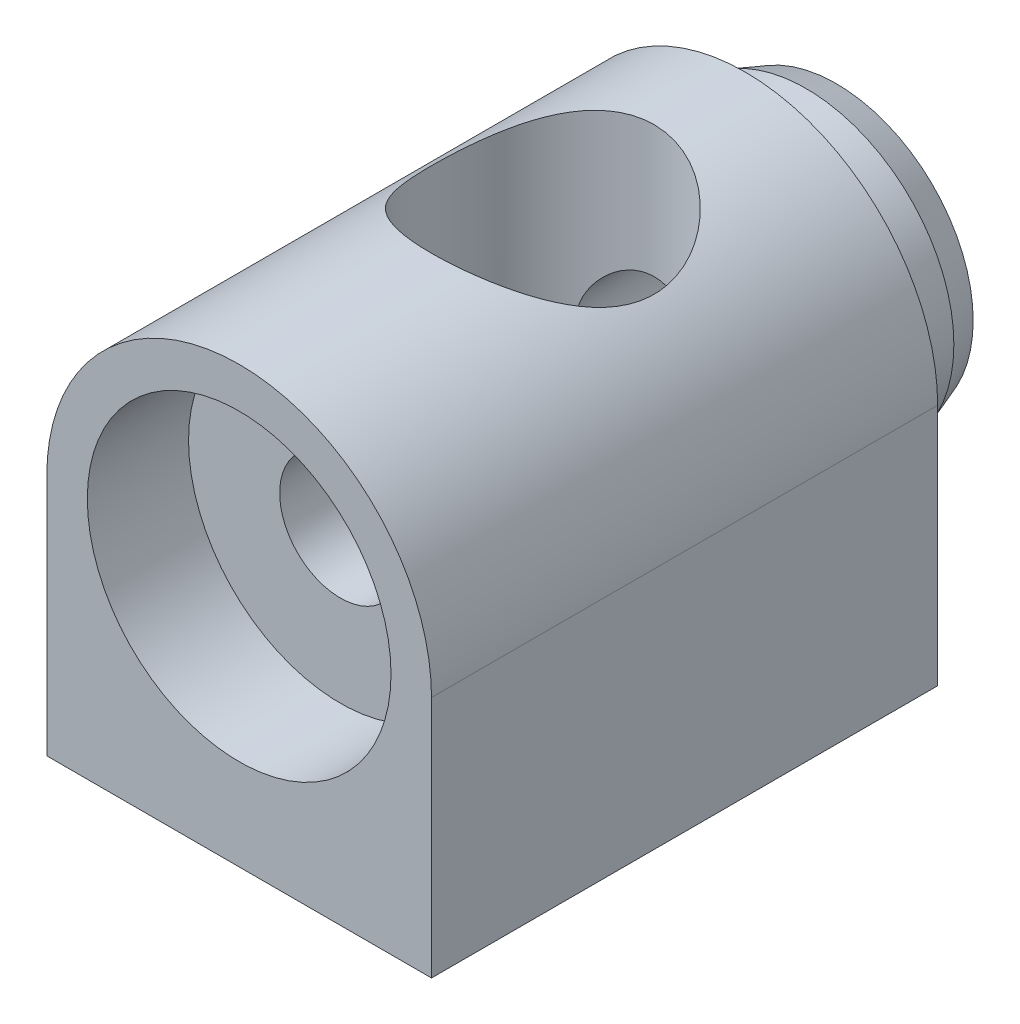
ISO-10303-21;
HEADER;
FILE_DESCRIPTION(('STEP AP214'),'2;1');
FILE_NAME('part.step','',(''),(''),'','','');
FILE_SCHEMA(('AUTOMOTIVE_DESIGN { 1 0 10303 214 1 1 1 1 }'));
ENDSEC;
DATA;
#1=APPLICATION_CONTEXT('core data for automotive mechanical design processes');
#2=APPLICATION_PROTOCOL_DEFINITION('international standard','automotive_design',2000,#1);
#3=PRODUCT_CONTEXT('',#1,'mechanical');
#4=PRODUCT('Part','Part','',(#3));
#5=PRODUCT_RELATED_PRODUCT_CATEGORY('part','',(#4));
#6=PRODUCT_DEFINITION_FORMATION('','',#4);
#7=PRODUCT_DEFINITION_CONTEXT('part definition',#1,'design');
#8=PRODUCT_DEFINITION('design','',#6,#7);
#9=PRODUCT_DEFINITION_SHAPE('','',#8);
#10=(LENGTH_UNIT() NAMED_UNIT(*) SI_UNIT(.MILLI.,.METRE.));
#11=(NAMED_UNIT(*) PLANE_ANGLE_UNIT() SI_UNIT($,.RADIAN.));
#12=(NAMED_UNIT(*) SI_UNIT($,.STERADIAN.) SOLID_ANGLE_UNIT());
#13=UNCERTAINTY_MEASURE_WITH_UNIT(LENGTH_MEASURE(1.E-05),#10,'distance_accuracy_value','');
#14=(GEOMETRIC_REPRESENTATION_CONTEXT(3) GLOBAL_UNCERTAINTY_ASSIGNED_CONTEXT((#13)) GLOBAL_UNIT_ASSIGNED_CONTEXT((#10,
#11,#12)) REPRESENTATION_CONTEXT('',''));
#15=CARTESIAN_POINT('',(0.,0.,0.));
#16=DIRECTION('',(0.,0.,1.));
#17=DIRECTION('',(1.,0.,0.));
#18=AXIS2_PLACEMENT_3D('',#15,#16,#17);
#19=CARTESIAN_POINT('',(0.,-82.3561549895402,10.5));
#20=DIRECTION('',(0.,0.,-1.));
#21=DIRECTION('',(-1.,0.,0.));
#22=AXIS2_PLACEMENT_3D('',#19,#20,#21);
#23=PLANE('',#22);
#24=DIRECTION('',(0.866025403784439,0.5,0.));
#25=VECTOR('',#24,1.);
#26=CARTESIAN_POINT('',(0.,-84.7526353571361,10.5));
#27=LINE('',#26,#25);
#28=CARTESIAN_POINT('',(0.,-84.7526353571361,10.5));
#29=VERTEX_POINT('',#28);
#30=CARTESIAN_POINT('',(5.00000000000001,-81.865884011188,10.5));
#31=VERTEX_POINT('',#30);
#32=EDGE_CURVE('E217',#29,#31,#27,.T.);
#33=ORIENTED_EDGE('',*,*,#32,.T.);
#34=DIRECTION('',(0.,1.,0.));
#35=VECTOR('',#34,1.);
#36=CARTESIAN_POINT('',(5.,-81.865884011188,10.5));
#37=LINE('',#36,#35);
#38=CARTESIAN_POINT('',(5.,-76.0923813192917,10.5));
#39=VERTEX_POINT('',#38);
#40=EDGE_CURVE('E223',#31,#39,#37,.T.);
#41=ORIENTED_EDGE('',*,*,#40,.T.);
#42=DIRECTION('',(-0.866025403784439,0.5,0.));
#43=VECTOR('',#42,1.);
#44=CARTESIAN_POINT('',(5.,-76.0923813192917,10.5));
#45=LINE('',#44,#43);
#46=CARTESIAN_POINT('',(0.,-73.2056299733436,10.5));
#47=VERTEX_POINT('',#46);
#48=EDGE_CURVE('E190',#39,#47,#45,.T.);
#49=ORIENTED_EDGE('',*,*,#48,.T.);
#50=DIRECTION('',(-0.866025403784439,-0.5,0.));
#51=VECTOR('',#50,1.);
#52=CARTESIAN_POINT('',(0.,-73.2056299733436,10.5));
#53=LINE('',#52,#51);
#54=CARTESIAN_POINT('',(-5.,-76.0923813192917,10.5));
#55=VERTEX_POINT('',#54);
#56=EDGE_CURVE('E199',#47,#55,#53,.T.);
#57=ORIENTED_EDGE('',*,*,#56,.T.);
#58=DIRECTION('',(0.,1.,0.));
#59=VECTOR('',#58,1.);
#60=CARTESIAN_POINT('',(-5.,-76.0923813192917,10.5));
#61=LINE('',#60,#59);
#62=CARTESIAN_POINT('',(-5.,-81.865884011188,10.5));
#63=VERTEX_POINT('',#62);
#64=EDGE_CURVE('E205',#55,#63,#61,.F.);
#65=ORIENTED_EDGE('',*,*,#64,.T.);
#66=DIRECTION('',(0.866025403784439,-0.5,0.));
#67=VECTOR('',#66,1.);
#68=CARTESIAN_POINT('',(-5.,-81.865884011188,10.5));
#69=LINE('',#68,#67);
#70=EDGE_CURVE('E211',#63,#29,#69,.T.);
#71=ORIENTED_EDGE('',*,*,#70,.T.);
#72=EDGE_LOOP('',(#33,#41,#49,#57,#65,#71));
#73=FACE_BOUND('',#72,.T.);
#74=CARTESIAN_POINT('',(0.,-78.9791326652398,10.4999999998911));
#75=DIRECTION('',(0.,0.,1.));
#76=DIRECTION('',(1.,0.,0.));
#77=AXIS2_PLACEMENT_3D('',#74,#75,#76);
#78=CIRCLE('',#77,6.75404464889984);
#79=CARTESIAN_POINT('',(6.75404464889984,-78.9791326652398,10.4999999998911));
#80=VERTEX_POINT('',#79);
#81=EDGE_CURVE('E18',#80,#80,#78,.T.);
#82=ORIENTED_EDGE('',*,*,#81,.F.);
#83=EDGE_LOOP('',(#82));
#84=FACE_BOUND('',#83,.T.);
#85=ADVANCED_FACE('F15',(#73,#84),#23,.T.);
#86=CARTESIAN_POINT('',(0.,-93.9791326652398,33.));
#87=DIRECTION('',(0.,1.,0.));
#88=DIRECTION('',(0.,0.,1.));
#89=AXIS2_PLACEMENT_3D('',#86,#87,#88);
#90=PLANE('',#89);
#91=DIRECTION('',(0.,0.,-1.));
#92=VECTOR('',#91,1.);
#93=CARTESIAN_POINT('',(-4.00000000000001,-93.9791326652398,33.));
#94=LINE('',#93,#92);
#95=CARTESIAN_POINT('',(-4.00000000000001,-93.9791326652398,37.));
#96=VERTEX_POINT('',#95);
#97=CARTESIAN_POINT('',(-4.00000000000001,-93.9791326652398,29.));
#98=VERTEX_POINT('',#97);
#99=EDGE_CURVE('E169',#96,#98,#94,.T.);
#100=ORIENTED_EDGE('',*,*,#99,.T.);
#101=DIRECTION('',(1.,0.,0.));
#102=VECTOR('',#101,1.);
#103=CARTESIAN_POINT('',(0.,-93.9791326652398,29.));
#104=LINE('',#103,#102);
#105=CARTESIAN_POINT('',(3.99999999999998,-93.9791326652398,29.));
#106=VERTEX_POINT('',#105);
#107=EDGE_CURVE('E187',#98,#106,#104,.T.);
#108=ORIENTED_EDGE('',*,*,#107,.T.);
#109=DIRECTION('',(0.,0.,1.));
#110=VECTOR('',#109,1.);
#111=CARTESIAN_POINT('',(3.99999999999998,-93.9791326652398,33.));
#112=LINE('',#111,#110);
#113=CARTESIAN_POINT('',(3.99999999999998,-93.9791326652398,37.));
#114=VERTEX_POINT('',#113);
#115=EDGE_CURVE('E181',#106,#114,#112,.T.);
#116=ORIENTED_EDGE('',*,*,#115,.T.);
#117=DIRECTION('',(-1.,0.,0.));
#118=VECTOR('',#117,1.);
#119=CARTESIAN_POINT('',(0.,-93.9791326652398,37.));
#120=LINE('',#119,#118);
#121=EDGE_CURVE('E175',#114,#96,#120,.T.);
#122=ORIENTED_EDGE('',*,*,#121,.T.);
#123=EDGE_LOOP('',(#100,#108,#116,#122));
#124=FACE_BOUND('',#123,.T.);
#125=ADVANCED_FACE('F363',(#124),#90,.F.);
#126=CARTESIAN_POINT('',(0.,-93.9791326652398,19.5));
#127=DIRECTION('',(0.,1.,0.));
#128=DIRECTION('',(0.,0.,1.));
#129=AXIS2_PLACEMENT_3D('',#126,#127,#128);
#130=PLANE('',#129);
#131=DIRECTION('',(0.,0.,-1.));
#132=VECTOR('',#131,1.);
#133=CARTESIAN_POINT('',(-4.00000000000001,-93.9791326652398,19.5));
#134=LINE('',#133,#132);
#135=CARTESIAN_POINT('',(-4.00000000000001,-93.9791326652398,21.));
#136=VERTEX_POINT('',#135);
#137=CARTESIAN_POINT('',(-4.00000000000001,-93.9791326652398,18.));
#138=VERTEX_POINT('',#137);
#139=EDGE_CURVE('E145',#136,#138,#134,.T.);
#140=ORIENTED_EDGE('',*,*,#139,.T.);
#141=DIRECTION('',(1.,0.,0.));
#142=VECTOR('',#141,1.);
#143=CARTESIAN_POINT('',(0.,-93.9791326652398,18.));
#144=LINE('',#143,#142);
#145=CARTESIAN_POINT('',(3.99999999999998,-93.9791326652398,18.));
#146=VERTEX_POINT('',#145);
#147=EDGE_CURVE('E163',#138,#146,#144,.T.);
#148=ORIENTED_EDGE('',*,*,#147,.T.);
#149=DIRECTION('',(0.,0.,1.));
#150=VECTOR('',#149,1.);
#151=CARTESIAN_POINT('',(3.99999999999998,-93.9791326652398,19.5));
#152=LINE('',#151,#150);
#153=CARTESIAN_POINT('',(3.99999999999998,-93.9791326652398,21.));
#154=VERTEX_POINT('',#153);
#155=EDGE_CURVE('E157',#146,#154,#152,.T.);
#156=ORIENTED_EDGE('',*,*,#155,.T.);
#157=DIRECTION('',(-1.,0.,0.));
#158=VECTOR('',#157,1.);
#159=CARTESIAN_POINT('',(0.,-93.9791326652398,21.));
#160=LINE('',#159,#158);
#161=EDGE_CURVE('E151',#154,#136,#160,.T.);
#162=ORIENTED_EDGE('',*,*,#161,.T.);
#163=EDGE_LOOP('',(#140,#148,#156,#162));
#164=FACE_BOUND('',#163,.T.);
#165=ADVANCED_FACE('F360',(#164),#130,.F.);
#166=CARTESIAN_POINT('',(5.,-81.865884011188,15.5));
#167=DIRECTION('',(1.,0.,0.));
#168=DIRECTION('',(0.,0.,-1.));
#169=AXIS2_PLACEMENT_3D('',#166,#167,#168);
#170=PLANE('',#169);
#171=DIRECTION('',(0.,0.,1.));
#172=VECTOR('',#171,1.);
#173=CARTESIAN_POINT('',(5.00000000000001,-81.865884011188,15.5));
#174=LINE('',#173,#172);
#175=CARTESIAN_POINT('',(5.00000000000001,-81.865884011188,15.5));
#176=VERTEX_POINT('',#175);
#177=EDGE_CURVE('E220',#31,#176,#174,.T.);
#178=ORIENTED_EDGE('',*,*,#177,.T.);
#179=DIRECTION('',(0.,1.,0.));
#180=VECTOR('',#179,1.);
#181=CARTESIAN_POINT('',(5.,-78.9791326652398,15.5));
#182=LINE('',#181,#180);
#183=CARTESIAN_POINT('',(5.,-76.0923813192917,15.5));
#184=VERTEX_POINT('',#183);
#185=EDGE_CURVE('E139',#184,#176,#182,.F.);
#186=ORIENTED_EDGE('',*,*,#185,.F.);
#187=DIRECTION('',(0.,0.,1.));
#188=VECTOR('',#187,1.);
#189=CARTESIAN_POINT('',(5.,-76.0923813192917,15.5));
#190=LINE('',#189,#188);
#191=EDGE_CURVE('E193',#184,#39,#190,.F.);
#192=ORIENTED_EDGE('',*,*,#191,.T.);
#193=ORIENTED_EDGE('',*,*,#40,.F.);
#194=EDGE_LOOP('',(#178,#186,#192,#193));
#195=FACE_BOUND('',#194,.T.);
#196=ADVANCED_FACE('F356',(#195),#170,.F.);
#197=CARTESIAN_POINT('',(0.,-84.7526353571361,15.5));
#198=DIRECTION('',(0.5,-0.866025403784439,0.));
#199=DIRECTION('',(0.866025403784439,0.5,0.));
#200=AXIS2_PLACEMENT_3D('',#197,#198,#199);
#201=PLANE('',#200);
#202=DIRECTION('',(0.,0.,1.));
#203=VECTOR('',#202,1.);
#204=CARTESIAN_POINT('',(0.,-84.7526353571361,15.5));
#205=LINE('',#204,#203);
#206=CARTESIAN_POINT('',(0.,-84.7526353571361,15.5));
#207=VERTEX_POINT('',#206);
#208=EDGE_CURVE('E214',#29,#207,#205,.T.);
#209=ORIENTED_EDGE('',*,*,#208,.T.);
#210=DIRECTION('',(-0.866025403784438,-0.500000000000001,0.));
#211=VECTOR('',#210,1.);
#212=CARTESIAN_POINT('',(5.,-81.865884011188,15.5));
#213=LINE('',#212,#211);
#214=EDGE_CURVE('E136',#176,#207,#213,.T.);
#215=ORIENTED_EDGE('',*,*,#214,.F.);
#216=ORIENTED_EDGE('',*,*,#177,.F.);
#217=ORIENTED_EDGE('',*,*,#32,.F.);
#218=EDGE_LOOP('',(#209,#215,#216,#217));
#219=FACE_BOUND('',#218,.T.);
#220=ADVANCED_FACE('F352',(#219),#201,.F.);
#221=CARTESIAN_POINT('',(-5.,-81.865884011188,15.5));
#222=DIRECTION('',(-0.5,-0.866025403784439,0.));
#223=DIRECTION('',(0.866025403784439,-0.5,0.));
#224=AXIS2_PLACEMENT_3D('',#221,#222,#223);
#225=PLANE('',#224);
#226=DIRECTION('',(0.,0.,1.));
#227=VECTOR('',#226,1.);
#228=CARTESIAN_POINT('',(-5.,-81.865884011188,15.5));
#229=LINE('',#228,#227);
#230=CARTESIAN_POINT('',(-5.,-81.865884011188,15.5));
#231=VERTEX_POINT('',#230);
#232=EDGE_CURVE('E208',#63,#231,#229,.T.);
#233=ORIENTED_EDGE('',*,*,#232,.T.);
#234=DIRECTION('',(-0.866025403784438,0.500000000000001,0.));
#235=VECTOR('',#234,1.);
#236=CARTESIAN_POINT('',(0.,-84.7526353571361,15.5));
#237=LINE('',#236,#235);
#238=EDGE_CURVE('E133',#207,#231,#237,.T.);
#239=ORIENTED_EDGE('',*,*,#238,.F.);
#240=ORIENTED_EDGE('',*,*,#208,.F.);
#241=ORIENTED_EDGE('',*,*,#70,.F.);
#242=EDGE_LOOP('',(#233,#239,#240,#241));
#243=FACE_BOUND('',#242,.T.);
#244=ADVANCED_FACE('F348',(#243),#225,.F.);
#245=CARTESIAN_POINT('',(-5.,-76.0923813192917,15.5));
#246=DIRECTION('',(-1.,0.,0.));
#247=DIRECTION('',(0.,0.,1.));
#248=AXIS2_PLACEMENT_3D('',#245,#246,#247);
#249=PLANE('',#248);
#250=DIRECTION('',(0.,0.,1.));
#251=VECTOR('',#250,1.);
#252=CARTESIAN_POINT('',(-5.,-76.0923813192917,15.5));
#253=LINE('',#252,#251);
#254=CARTESIAN_POINT('',(-5.,-76.0923813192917,15.5));
#255=VERTEX_POINT('',#254);
#256=EDGE_CURVE('E202',#55,#255,#253,.T.);
#257=ORIENTED_EDGE('',*,*,#256,.T.);
#258=DIRECTION('',(0.,1.,0.));
#259=VECTOR('',#258,1.);
#260=CARTESIAN_POINT('',(-5.,-78.9791326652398,15.5));
#261=LINE('',#260,#259);
#262=EDGE_CURVE('E130',#231,#255,#261,.T.);
#263=ORIENTED_EDGE('',*,*,#262,.F.);
#264=ORIENTED_EDGE('',*,*,#232,.F.);
#265=ORIENTED_EDGE('',*,*,#64,.F.);
#266=EDGE_LOOP('',(#257,#263,#264,#265));
#267=FACE_BOUND('',#266,.T.);
#268=ADVANCED_FACE('F344',(#267),#249,.F.);
#269=CARTESIAN_POINT('',(0.,-73.2056299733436,15.5));
#270=DIRECTION('',(-0.5,0.866025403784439,0.));
#271=DIRECTION('',(-0.866025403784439,-0.5,0.));
#272=AXIS2_PLACEMENT_3D('',#269,#270,#271);
#273=PLANE('',#272);
#274=DIRECTION('',(0.,0.,1.));
#275=VECTOR('',#274,1.);
#276=CARTESIAN_POINT('',(0.,-73.2056299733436,15.5));
#277=LINE('',#276,#275);
#278=CARTESIAN_POINT('',(0.,-73.2056299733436,15.5));
#279=VERTEX_POINT('',#278);
#280=EDGE_CURVE('E196',#47,#279,#277,.T.);
#281=ORIENTED_EDGE('',*,*,#280,.T.);
#282=DIRECTION('',(0.866025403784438,0.500000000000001,0.));
#283=VECTOR('',#282,1.);
#284=CARTESIAN_POINT('',(-5.,-76.0923813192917,15.5));
#285=LINE('',#284,#283);
#286=EDGE_CURVE('E127',#255,#279,#285,.T.);
#287=ORIENTED_EDGE('',*,*,#286,.F.);
#288=ORIENTED_EDGE('',*,*,#256,.F.);
#289=ORIENTED_EDGE('',*,*,#56,.F.);
#290=EDGE_LOOP('',(#281,#287,#288,#289));
#291=FACE_BOUND('',#290,.T.);
#292=ADVANCED_FACE('F340',(#291),#273,.F.);
#293=CARTESIAN_POINT('',(5.,-76.0923813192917,15.5));
#294=DIRECTION('',(0.5,0.866025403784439,0.));
#295=DIRECTION('',(-0.866025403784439,0.5,0.));
#296=AXIS2_PLACEMENT_3D('',#293,#294,#295);
#297=PLANE('',#296);
#298=ORIENTED_EDGE('',*,*,#191,.F.);
#299=DIRECTION('',(0.866025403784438,-0.500000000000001,0.));
#300=VECTOR('',#299,1.);
#301=CARTESIAN_POINT('',(0.,-73.2056299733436,15.5));
#302=LINE('',#301,#300);
#303=EDGE_CURVE('E122',#279,#184,#302,.T.);
#304=ORIENTED_EDGE('',*,*,#303,.F.);
#305=ORIENTED_EDGE('',*,*,#280,.F.);
#306=ORIENTED_EDGE('',*,*,#48,.F.);
#307=EDGE_LOOP('',(#298,#304,#305,#306));
#308=FACE_BOUND('',#307,.T.);
#309=ADVANCED_FACE('F336',(#308),#297,.F.);
#310=CARTESIAN_POINT('',(0.,-78.9791326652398,12.0000000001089));
#311=DIRECTION('',(0.,0.,1.));
#312=DIRECTION('',(1.,0.,0.));
#313=AXIS2_PLACEMENT_3D('',#310,#311,#312);
#314=CONICAL_SURFACE('',#313,7.29999999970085,0.349065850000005);
#315=ORIENTED_EDGE('',*,*,#81,.T.);
#316=EDGE_LOOP('',(#315));
#317=FACE_BOUND('',#316,.T.);
#318=CARTESIAN_POINT('',(0.,-78.9791326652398,12.));
#319=DIRECTION('',(0.,0.,-1.));
#320=DIRECTION('',(-1.,0.,0.));
#321=AXIS2_PLACEMENT_3D('',#318,#319,#320);
#322=CIRCLE('',#321,7.3);
#323=CARTESIAN_POINT('',(-7.3,-78.9791326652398,12.));
#324=VERTEX_POINT('',#323);
#325=EDGE_CURVE('E119',#324,#324,#322,.F.);
#326=ORIENTED_EDGE('',*,*,#325,.F.);
#327=EDGE_LOOP('',(#326));
#328=FACE_BOUND('',#327,.T.);
#329=ADVANCED_FACE('F332',(#317,#328),#314,.T.);
#330=CARTESIAN_POINT('',(0.,-92.4791326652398,29.));
#331=DIRECTION('',(0.,0.,1.));
#332=DIRECTION('',(1.,0.,0.));
#333=AXIS2_PLACEMENT_3D('',#330,#331,#332);
#334=PLANE('',#333);
#335=ORIENTED_EDGE('',*,*,#107,.F.);
#336=DIRECTION('',(0.,1.,0.));
#337=VECTOR('',#336,1.);
#338=CARTESIAN_POINT('',(-4.00000000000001,-92.4791326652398,29.));
#339=LINE('',#338,#337);
#340=CARTESIAN_POINT('',(-4.00000000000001,-90.9791326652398,29.));
#341=VERTEX_POINT('',#340);
#342=EDGE_CURVE('E166',#98,#341,#339,.T.);
#343=ORIENTED_EDGE('',*,*,#342,.T.);
#344=DIRECTION('',(1.,0.,0.));
#345=VECTOR('',#344,1.);
#346=CARTESIAN_POINT('',(0.,-90.9791326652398,29.));
#347=LINE('',#346,#345);
#348=CARTESIAN_POINT('',(3.99999999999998,-90.9791326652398,29.));
#349=VERTEX_POINT('',#348);
#350=EDGE_CURVE('E111',#341,#349,#347,.T.);
#351=ORIENTED_EDGE('',*,*,#350,.T.);
#352=DIRECTION('',(0.,1.,0.));
#353=VECTOR('',#352,1.);
#354=CARTESIAN_POINT('',(3.99999999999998,-92.4791326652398,29.));
#355=LINE('',#354,#353);
#356=EDGE_CURVE('E184',#349,#106,#355,.F.);
#357=ORIENTED_EDGE('',*,*,#356,.T.);
#358=EDGE_LOOP('',(#335,#343,#351,#357));
#359=FACE_BOUND('',#358,.T.);
#360=ADVANCED_FACE('F328',(#359),#334,.F.);
#361=CARTESIAN_POINT('',(3.99999999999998,-92.4791326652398,33.));
#362=DIRECTION('',(-1.,0.,0.));
#363=DIRECTION('',(0.,0.,1.));
#364=AXIS2_PLACEMENT_3D('',#361,#362,#363);
#365=PLANE('',#364);
#366=ORIENTED_EDGE('',*,*,#115,.F.);
#367=ORIENTED_EDGE('',*,*,#356,.F.);
#368=DIRECTION('',(0.,0.,1.));
#369=VECTOR('',#368,1.);
#370=CARTESIAN_POINT('',(3.99999999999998,-90.9791326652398,27.5));
#371=LINE('',#370,#369);
#372=CARTESIAN_POINT('',(3.99999999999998,-90.9791326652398,37.));
#373=VERTEX_POINT('',#372);
#374=EDGE_CURVE('E108',#349,#373,#371,.T.);
#375=ORIENTED_EDGE('',*,*,#374,.T.);
#376=DIRECTION('',(0.,1.,0.));
#377=VECTOR('',#376,1.);
#378=CARTESIAN_POINT('',(3.99999999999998,-92.4791326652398,37.));
#379=LINE('',#378,#377);
#380=EDGE_CURVE('E178',#373,#114,#379,.F.);
#381=ORIENTED_EDGE('',*,*,#380,.T.);
#382=EDGE_LOOP('',(#366,#367,#375,#381));
#383=FACE_BOUND('',#382,.T.);
#384=ADVANCED_FACE('F324',(#383),#365,.F.);
#385=CARTESIAN_POINT('',(0.,-92.4791326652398,37.));
#386=DIRECTION('',(0.,0.,-1.));
#387=DIRECTION('',(-1.,0.,0.));
#388=AXIS2_PLACEMENT_3D('',#385,#386,#387);
#389=PLANE('',#388);
#390=ORIENTED_EDGE('',*,*,#121,.F.);
#391=ORIENTED_EDGE('',*,*,#380,.F.);
#392=DIRECTION('',(1.,0.,0.));
#393=VECTOR('',#392,1.);
#394=CARTESIAN_POINT('',(0.,-90.9791326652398,37.));
#395=LINE('',#394,#393);
#396=CARTESIAN_POINT('',(-4.00000000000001,-90.9791326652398,37.));
#397=VERTEX_POINT('',#396);
#398=EDGE_CURVE('E105',#373,#397,#395,.F.);
#399=ORIENTED_EDGE('',*,*,#398,.T.);
#400=DIRECTION('',(0.,1.,0.));
#401=VECTOR('',#400,1.);
#402=CARTESIAN_POINT('',(-4.00000000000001,-92.4791326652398,37.));
#403=LINE('',#402,#401);
#404=EDGE_CURVE('E172',#397,#96,#403,.F.);
#405=ORIENTED_EDGE('',*,*,#404,.T.);
#406=EDGE_LOOP('',(#390,#391,#399,#405));
#407=FACE_BOUND('',#406,.T.);
#408=ADVANCED_FACE('F320',(#407),#389,.F.);
#409=CARTESIAN_POINT('',(-4.00000000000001,-92.4791326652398,33.));
#410=DIRECTION('',(1.,0.,0.));
#411=DIRECTION('',(0.,0.,-1.));
#412=AXIS2_PLACEMENT_3D('',#409,#410,#411);
#413=PLANE('',#412);
#414=ORIENTED_EDGE('',*,*,#99,.F.);
#415=ORIENTED_EDGE('',*,*,#404,.F.);
#416=DIRECTION('',(0.,0.,1.));
#417=VECTOR('',#416,1.);
#418=CARTESIAN_POINT('',(-4.00000000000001,-90.9791326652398,27.5));
#419=LINE('',#418,#417);
#420=EDGE_CURVE('E102',#397,#341,#419,.F.);
#421=ORIENTED_EDGE('',*,*,#420,.T.);
#422=ORIENTED_EDGE('',*,*,#342,.F.);
#423=EDGE_LOOP('',(#414,#415,#421,#422));
#424=FACE_BOUND('',#423,.T.);
#425=ADVANCED_FACE('F316',(#424),#413,.F.);
#426=CARTESIAN_POINT('',(0.,-92.4791326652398,18.));
#427=DIRECTION('',(0.,0.,1.));
#428=DIRECTION('',(1.,0.,0.));
#429=AXIS2_PLACEMENT_3D('',#426,#427,#428);
#430=PLANE('',#429);
#431=ORIENTED_EDGE('',*,*,#147,.F.);
#432=DIRECTION('',(0.,1.,0.));
#433=VECTOR('',#432,1.);
#434=CARTESIAN_POINT('',(-4.00000000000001,-92.4791326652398,18.));
#435=LINE('',#434,#433);
#436=CARTESIAN_POINT('',(-4.00000000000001,-90.9791326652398,18.));
#437=VERTEX_POINT('',#436);
#438=EDGE_CURVE('E142',#138,#437,#435,.T.);
#439=ORIENTED_EDGE('',*,*,#438,.T.);
#440=DIRECTION('',(1.,0.,0.));
#441=VECTOR('',#440,1.);
#442=CARTESIAN_POINT('',(0.,-90.9791326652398,18.));
#443=LINE('',#442,#441);
#444=CARTESIAN_POINT('',(3.99999999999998,-90.9791326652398,18.));
#445=VERTEX_POINT('',#444);
#446=EDGE_CURVE('E99',#437,#445,#443,.T.);
#447=ORIENTED_EDGE('',*,*,#446,.T.);
#448=DIRECTION('',(0.,1.,0.));
#449=VECTOR('',#448,1.);
#450=CARTESIAN_POINT('',(3.99999999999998,-92.4791326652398,18.));
#451=LINE('',#450,#449);
#452=EDGE_CURVE('E160',#445,#146,#451,.F.);
#453=ORIENTED_EDGE('',*,*,#452,.T.);
#454=EDGE_LOOP('',(#431,#439,#447,#453));
#455=FACE_BOUND('',#454,.T.);
#456=ADVANCED_FACE('F312',(#455),#430,.F.);
#457=CARTESIAN_POINT('',(3.99999999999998,-92.4791326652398,19.5));
#458=DIRECTION('',(-1.,0.,0.));
#459=DIRECTION('',(0.,0.,1.));
#460=AXIS2_PLACEMENT_3D('',#457,#458,#459);
#461=PLANE('',#460);
#462=ORIENTED_EDGE('',*,*,#155,.F.);
#463=ORIENTED_EDGE('',*,*,#452,.F.);
#464=DIRECTION('',(0.,0.,1.));
#465=VECTOR('',#464,1.);
#466=CARTESIAN_POINT('',(3.99999999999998,-90.9791326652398,27.5));
#467=LINE('',#466,#465);
#468=CARTESIAN_POINT('',(3.99999999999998,-90.9791326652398,21.));
#469=VERTEX_POINT('',#468);
#470=EDGE_CURVE('E96',#445,#469,#467,.T.);
#471=ORIENTED_EDGE('',*,*,#470,.T.);
#472=DIRECTION('',(0.,1.,0.));
#473=VECTOR('',#472,1.);
#474=CARTESIAN_POINT('',(3.99999999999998,-92.4791326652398,21.));
#475=LINE('',#474,#473);
#476=EDGE_CURVE('E154',#469,#154,#475,.F.);
#477=ORIENTED_EDGE('',*,*,#476,.T.);
#478=EDGE_LOOP('',(#462,#463,#471,#477));
#479=FACE_BOUND('',#478,.T.);
#480=ADVANCED_FACE('F308',(#479),#461,.F.);
#481=CARTESIAN_POINT('',(0.,-92.4791326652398,21.));
#482=DIRECTION('',(0.,0.,-1.));
#483=DIRECTION('',(-1.,0.,0.));
#484=AXIS2_PLACEMENT_3D('',#481,#482,#483);
#485=PLANE('',#484);
#486=ORIENTED_EDGE('',*,*,#161,.F.);
#487=ORIENTED_EDGE('',*,*,#476,.F.);
#488=DIRECTION('',(1.,0.,0.));
#489=VECTOR('',#488,1.);
#490=CARTESIAN_POINT('',(0.,-90.9791326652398,21.));
#491=LINE('',#490,#489);
#492=CARTESIAN_POINT('',(-4.00000000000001,-90.9791326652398,21.));
#493=VERTEX_POINT('',#492);
#494=EDGE_CURVE('E93',#469,#493,#491,.F.);
#495=ORIENTED_EDGE('',*,*,#494,.T.);
#496=DIRECTION('',(0.,1.,0.));
#497=VECTOR('',#496,1.);
#498=CARTESIAN_POINT('',(-4.00000000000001,-92.4791326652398,21.));
#499=LINE('',#498,#497);
#500=EDGE_CURVE('E148',#493,#136,#499,.F.);
#501=ORIENTED_EDGE('',*,*,#500,.T.);
#502=EDGE_LOOP('',(#486,#487,#495,#501));
#503=FACE_BOUND('',#502,.T.);
#504=ADVANCED_FACE('F304',(#503),#485,.F.);
#505=CARTESIAN_POINT('',(-4.00000000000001,-92.4791326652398,19.5));
#506=DIRECTION('',(1.,0.,0.));
#507=DIRECTION('',(0.,0.,-1.));
#508=AXIS2_PLACEMENT_3D('',#505,#506,#507);
#509=PLANE('',#508);
#510=ORIENTED_EDGE('',*,*,#139,.F.);
#511=ORIENTED_EDGE('',*,*,#500,.F.);
#512=DIRECTION('',(0.,0.,1.));
#513=VECTOR('',#512,1.);
#514=CARTESIAN_POINT('',(-4.00000000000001,-90.9791326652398,27.5));
#515=LINE('',#514,#513);
#516=EDGE_CURVE('E89',#493,#437,#515,.F.);
#517=ORIENTED_EDGE('',*,*,#516,.T.);
#518=ORIENTED_EDGE('',*,*,#438,.F.);
#519=EDGE_LOOP('',(#510,#511,#517,#518));
#520=FACE_BOUND('',#519,.T.);
#521=ADVANCED_FACE('F300',(#520),#509,.F.);
#522=CARTESIAN_POINT('',(0.,-78.9791326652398,35.));
#523=DIRECTION('',(0.,0.,-1.));
#524=DIRECTION('',(-1.,0.,0.));
#525=AXIS2_PLACEMENT_3D('',#522,#523,#524);
#526=PLANE('',#525);
#527=CARTESIAN_POINT('',(0.,-78.9791326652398,35.));
#528=DIRECTION('',(0.,0.,1.));
#529=DIRECTION('',(1.,0.,0.));
#530=AXIS2_PLACEMENT_3D('',#527,#528,#529);
#531=CIRCLE('',#530,3.);
#532=CARTESIAN_POINT('',(3.,-78.9791326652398,35.));
#533=VERTEX_POINT('',#532);
#534=EDGE_CURVE('E502',#533,#533,#531,.F.);
#535=ORIENTED_EDGE('',*,*,#534,.T.);
#536=EDGE_LOOP('',(#535));
#537=FACE_BOUND('',#536,.T.);
#538=CARTESIAN_POINT('',(0.,-78.9791326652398,35.));
#539=DIRECTION('',(0.,0.,1.));
#540=DIRECTION('',(1.,0.,0.));
#541=AXIS2_PLACEMENT_3D('',#538,#539,#540);
#542=CIRCLE('',#541,7.5);
#543=CARTESIAN_POINT('',(7.5,-78.9791326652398,35.));
#544=VERTEX_POINT('',#543);
#545=EDGE_CURVE('E92',#544,#544,#542,.T.);
#546=ORIENTED_EDGE('',*,*,#545,.T.);
#547=EDGE_LOOP('',(#546));
#548=FACE_BOUND('',#547,.T.);
#549=ADVANCED_FACE('F296',(#537,#548),#526,.F.);
#550=CARTESIAN_POINT('',(0.,-78.9791326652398,15.5));
#551=DIRECTION('',(0.,0.,-1.));
#552=DIRECTION('',(-1.,0.,0.));
#553=AXIS2_PLACEMENT_3D('',#550,#551,#552);
#554=PLANE('',#553);
#555=CARTESIAN_POINT('',(0.,-78.9791326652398,15.5));
#556=DIRECTION('',(0.,0.,1.));
#557=DIRECTION('',(1.,0.,0.));
#558=AXIS2_PLACEMENT_3D('',#555,#556,#557);
#559=CIRCLE('',#558,3.);
#560=CARTESIAN_POINT('',(3.,-78.9791326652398,15.5));
#561=VERTEX_POINT('',#560);
#562=EDGE_CURVE('E499',#561,#561,#559,.T.);
#563=ORIENTED_EDGE('',*,*,#562,.T.);
#564=EDGE_LOOP('',(#563));
#565=FACE_BOUND('',#564,.T.);
#566=ORIENTED_EDGE('',*,*,#286,.T.);
#567=ORIENTED_EDGE('',*,*,#303,.T.);
#568=ORIENTED_EDGE('',*,*,#185,.T.);
#569=ORIENTED_EDGE('',*,*,#214,.T.);
#570=ORIENTED_EDGE('',*,*,#238,.T.);
#571=ORIENTED_EDGE('',*,*,#262,.T.);
#572=EDGE_LOOP('',(#566,#567,#568,#569,#570,#571));
#573=FACE_BOUND('',#572,.T.);
#574=ADVANCED_FACE('F292',(#565,#573),#554,.T.);
#575=CARTESIAN_POINT('',(0.,-88.9791326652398,25.));
#576=DIRECTION('',(0.,1.,0.));
#577=DIRECTION('',(0.,0.,1.));
#578=AXIS2_PLACEMENT_3D('',#575,#576,#577);
#579=CYLINDRICAL_SURFACE('',#578,3.25);
#580=CARTESIAN_POINT('',(0.,-86.9791326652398,25.));
#581=DIRECTION('',(0.,1.,0.));
#582=DIRECTION('',(0.,0.,1.));
#583=AXIS2_PLACEMENT_3D('',#580,#581,#582);
#584=CIRCLE('',#583,3.25);
#585=CARTESIAN_POINT('',(0.,-86.9791326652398,28.25));
#586=VERTEX_POINT('',#585);
#587=EDGE_CURVE('E116',#586,#586,#584,.T.);
#588=ORIENTED_EDGE('',*,*,#587,.T.);
#589=EDGE_LOOP('',(#588));
#590=FACE_BOUND('',#589,.T.);
#591=CARTESIAN_POINT('',(0.,-90.9791326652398,25.));
#592=DIRECTION('',(0.,1.,0.));
#593=DIRECTION('',(0.,0.,1.));
#594=AXIS2_PLACEMENT_3D('',#591,#592,#593);
#595=CIRCLE('',#594,3.25);
#596=CARTESIAN_POINT('',(0.,-90.9791326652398,28.25));
#597=VERTEX_POINT('',#596);
#598=EDGE_CURVE('E114',#597,#597,#595,.F.);
#599=ORIENTED_EDGE('',*,*,#598,.T.);
#600=EDGE_LOOP('',(#599));
#601=FACE_BOUND('',#600,.T.);
#602=ADVANCED_FACE('F288',(#590,#601),#579,.F.);
#603=CARTESIAN_POINT('',(0.,-78.9791326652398,13.5));
#604=DIRECTION('',(0.,0.,-1.));
#605=DIRECTION('',(-1.,0.,0.));
#606=AXIS2_PLACEMENT_3D('',#603,#604,#605);
#607=CYLINDRICAL_SURFACE('',#606,7.3);
#608=ORIENTED_EDGE('',*,*,#325,.T.);
#609=EDGE_LOOP('',(#608));
#610=FACE_BOUND('',#609,.T.);
#611=CARTESIAN_POINT('',(0.,-78.9791326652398,15.));
#612=DIRECTION('',(0.,0.,-1.));
#613=DIRECTION('',(-1.,0.,0.));
#614=AXIS2_PLACEMENT_3D('',#611,#612,#613);
#615=CIRCLE('',#614,7.3);
#616=CARTESIAN_POINT('',(-7.3,-78.9791326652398,15.));
#617=VERTEX_POINT('',#616);
#618=EDGE_CURVE('E59',#617,#617,#615,.T.);
#619=ORIENTED_EDGE('',*,*,#618,.T.);
#620=EDGE_LOOP('',(#619));
#621=FACE_BOUND('',#620,.T.);
#622=ADVANCED_FACE('F284',(#610,#621),#607,.T.);
#623=CARTESIAN_POINT('',(0.,-90.9791326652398,27.5));
#624=DIRECTION('',(0.,1.,0.));
#625=DIRECTION('',(0.,0.,1.));
#626=AXIS2_PLACEMENT_3D('',#623,#624,#625);
#627=PLANE('',#626);
#628=ORIENTED_EDGE('',*,*,#494,.F.);
#629=ORIENTED_EDGE('',*,*,#470,.F.);
#630=ORIENTED_EDGE('',*,*,#446,.F.);
#631=ORIENTED_EDGE('',*,*,#516,.F.);
#632=EDGE_LOOP('',(#628,#629,#630,#631));
#633=FACE_BOUND('',#632,.T.);
#634=ORIENTED_EDGE('',*,*,#398,.F.);
#635=ORIENTED_EDGE('',*,*,#374,.F.);
#636=ORIENTED_EDGE('',*,*,#350,.F.);
#637=ORIENTED_EDGE('',*,*,#420,.F.);
#638=EDGE_LOOP('',(#634,#635,#636,#637));
#639=FACE_BOUND('',#638,.T.);
#640=ORIENTED_EDGE('',*,*,#598,.F.);
#641=EDGE_LOOP('',(#640));
#642=FACE_BOUND('',#641,.T.);
#643=DIRECTION('',(0.,0.,-1.));
#644=VECTOR('',#643,1.);
#645=CARTESIAN_POINT('',(-9.5,-90.9791326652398,27.5));
#646=LINE('',#645,#644);
#647=CARTESIAN_POINT('',(-9.5,-90.9791326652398,40.));
#648=VERTEX_POINT('',#647);
#649=CARTESIAN_POINT('',(-9.5,-90.9791326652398,15.));
#650=VERTEX_POINT('',#649);
#651=EDGE_CURVE('E82',#648,#650,#646,.T.);
#652=ORIENTED_EDGE('',*,*,#651,.T.);
#653=DIRECTION('',(1.,0.,0.));
#654=VECTOR('',#653,1.);
#655=CARTESIAN_POINT('',(0.,-90.9791326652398,15.));
#656=LINE('',#655,#654);
#657=CARTESIAN_POINT('',(9.49999999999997,-90.9791326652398,15.));
#658=VERTEX_POINT('',#657);
#659=EDGE_CURVE('E60',#650,#658,#656,.T.);
#660=ORIENTED_EDGE('',*,*,#659,.T.);
#661=DIRECTION('',(0.,0.,1.));
#662=VECTOR('',#661,1.);
#663=CARTESIAN_POINT('',(9.49999999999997,-90.9791326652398,27.5));
#664=LINE('',#663,#662);
#665=CARTESIAN_POINT('',(9.49999999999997,-90.9791326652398,40.));
#666=VERTEX_POINT('',#665);
#667=EDGE_CURVE('E56',#658,#666,#664,.T.);
#668=ORIENTED_EDGE('',*,*,#667,.T.);
#669=DIRECTION('',(-1.,0.,0.));
#670=VECTOR('',#669,1.);
#671=CARTESIAN_POINT('',(0.,-90.9791326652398,40.));
#672=LINE('',#671,#670);
#673=EDGE_CURVE('E86',#666,#648,#672,.T.);
#674=ORIENTED_EDGE('',*,*,#673,.T.);
#675=EDGE_LOOP('',(#652,#660,#668,#674));
#676=FACE_BOUND('',#675,.T.);
#677=ADVANCED_FACE('F280',(#633,#639,#642,#676),#627,.F.);
#678=CARTESIAN_POINT('',(0.,-78.9791326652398,37.5));
#679=DIRECTION('',(0.,0.,1.));
#680=DIRECTION('',(1.,0.,0.));
#681=AXIS2_PLACEMENT_3D('',#678,#679,#680);
#682=CYLINDRICAL_SURFACE('',#681,7.5);
#683=CARTESIAN_POINT('',(0.,-78.9791326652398,40.));
#684=DIRECTION('',(0.,0.,1.));
#685=DIRECTION('',(1.,0.,0.));
#686=AXIS2_PLACEMENT_3D('',#683,#684,#685);
#687=CIRCLE('',#686,7.5);
#688=CARTESIAN_POINT('',(7.5,-78.9791326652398,40.));
#689=VERTEX_POINT('',#688);
#690=EDGE_CURVE('E258',#689,#689,#687,.T.);
#691=ORIENTED_EDGE('',*,*,#690,.T.);
#692=EDGE_LOOP('',(#691));
#693=FACE_BOUND('',#692,.T.);
#694=ORIENTED_EDGE('',*,*,#545,.F.);
#695=EDGE_LOOP('',(#694));
#696=FACE_BOUND('',#695,.T.);
#697=ADVANCED_FACE('F275',(#693,#696),#682,.F.);
#698=CARTESIAN_POINT('',(0.,-78.9791326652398,27.5));
#699=DIRECTION('',(0.,0.,1.));
#700=DIRECTION('',(1.,0.,0.));
#701=AXIS2_PLACEMENT_3D('',#698,#699,#700);
#702=CYLINDRICAL_SURFACE('',#701,3.);
#703=CARTESIAN_POINT('',(3.,-78.9791326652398,29.6097722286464));
#704=CARTESIAN_POINT('',(3.00000008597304,-79.056166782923,29.6097719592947));
#705=CARTESIAN_POINT('',(2.99702726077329,-79.1331954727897,29.6117116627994));
#706=CARTESIAN_POINT('',(2.98519422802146,-79.2866173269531,29.6193785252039));
#707=CARTESIAN_POINT('',(2.97633201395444,-79.3630102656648,29.6251069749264));
#708=CARTESIAN_POINT('',(2.94104477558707,-79.5904871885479,29.6476975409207));
#709=CARTESIAN_POINT('',(2.9059193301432,-79.739789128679,29.6699645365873));
#710=CARTESIAN_POINT('',(2.81459785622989,-80.0283610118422,29.7255494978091));
#711=CARTESIAN_POINT('',(2.75853128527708,-80.1676864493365,29.7587994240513));
#712=CARTESIAN_POINT('',(2.62731895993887,-80.4349345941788,29.8324787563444));
#713=CARTESIAN_POINT('',(2.55216945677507,-80.5628550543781,29.8729095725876));
#714=CARTESIAN_POINT('',(2.37619973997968,-80.8176014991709,29.9612787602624));
#715=CARTESIAN_POINT('',(2.27357166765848,-80.9430580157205,30.0095639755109));
#716=CARTESIAN_POINT('',(2.04929435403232,-81.1760761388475,30.1054164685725));
#717=CARTESIAN_POINT('',(1.92763399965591,-81.2836272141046,30.152983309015));
#718=CARTESIAN_POINT('',(1.65629104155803,-81.4866713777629,30.2468056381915));
#719=CARTESIAN_POINT('',(1.50511271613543,-81.5803915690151,30.2926149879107));
#720=CARTESIAN_POINT('',(1.18616326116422,-81.7404322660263,30.3730792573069));
#721=CARTESIAN_POINT('',(1.0184046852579,-81.8067733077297,30.4077425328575));
#722=CARTESIAN_POINT('',(0.685630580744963,-81.9044464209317,30.4594774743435));
#723=CARTESIAN_POINT('',(0.521519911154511,-81.9382048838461,30.4777594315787));
#724=CARTESIAN_POINT('',(0.189034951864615,-81.9778378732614,30.4992671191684));
#725=CARTESIAN_POINT('',(0.0206639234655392,-81.9837331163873,30.5025040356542));
#726=CARTESIAN_POINT('',(-0.296926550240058,-81.9681928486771,30.4940391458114));
#727=CARTESIAN_POINT('',(-0.446331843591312,-81.9495107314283,30.4838421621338));
#728=CARTESIAN_POINT('',(-0.739495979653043,-81.8904050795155,30.452053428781));
#729=CARTESIAN_POINT('',(-0.883254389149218,-81.8499798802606,30.4304608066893));
#730=CARTESIAN_POINT('',(-1.16318015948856,-81.7485078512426,30.377504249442));
#731=CARTESIAN_POINT('',(-1.29924531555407,-81.6872366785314,30.3460343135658));
#732=CARTESIAN_POINT('',(-1.55943450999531,-81.5462489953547,30.276015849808));
#733=CARTESIAN_POINT('',(-1.68355465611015,-81.466526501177,30.2374650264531));
#734=CARTESIAN_POINT('',(-1.93049616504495,-81.2811939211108,30.151895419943));
#735=CARTESIAN_POINT('',(-2.05176580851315,-81.1737292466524,30.1044120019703));
#736=CARTESIAN_POINT('',(-2.27546332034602,-80.9408671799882,30.0087026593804));
#737=CARTESIAN_POINT('',(-2.37787202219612,-80.815451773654,29.9604760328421));
#738=CARTESIAN_POINT('',(-2.56971030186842,-80.5371630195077,29.8640599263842));
#739=CARTESIAN_POINT('',(-2.65728391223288,-80.3828593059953,29.8162255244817));
#740=CARTESIAN_POINT('',(-2.76775917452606,-80.1399281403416,29.7530322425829));
#741=CARTESIAN_POINT('',(-2.80110743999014,-80.0570228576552,29.7333914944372));
#742=CARTESIAN_POINT('',(-2.86045239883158,-79.8878829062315,29.6977664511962));
#743=CARTESIAN_POINT('',(-2.88645402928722,-79.8016505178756,29.6817797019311));
#744=CARTESIAN_POINT('',(-2.92892496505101,-79.6335777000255,29.6553168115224));
#745=CARTESIAN_POINT('',(-2.94599263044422,-79.5519416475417,29.6445009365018));
#746=CARTESIAN_POINT('',(-2.97329911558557,-79.3871321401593,29.6270677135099));
#747=CARTESIAN_POINT('',(-2.98354185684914,-79.3039595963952,29.6204479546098));
#748=CARTESIAN_POINT('',(-2.99702159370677,-79.136862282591,29.6117165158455));
#749=CARTESIAN_POINT('',(-3.00026334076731,-79.0529380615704,29.609601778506));
#750=CARTESIAN_POINT('',(-2.99970273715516,-78.8851515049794,29.609964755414));
#751=CARTESIAN_POINT('',(-2.99590112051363,-78.8012891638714,29.6124419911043));
#752=CARTESIAN_POINT('',(-2.97607807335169,-78.5747386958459,29.6252821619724));
#753=CARTESIAN_POINT('',(-2.953267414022,-78.4328225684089,29.6400140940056));
#754=CARTESIAN_POINT('',(-2.88820038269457,-78.1553135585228,29.6807827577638));
#755=CARTESIAN_POINT('',(-2.84593574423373,-78.0197233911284,29.7068242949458));
#756=CARTESIAN_POINT('',(-2.74140566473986,-77.7518430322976,29.7684921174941));
#757=CARTESIAN_POINT('',(-2.67836135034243,-77.6199426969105,29.804481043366));
#758=CARTESIAN_POINT('',(-2.53470472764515,-77.3678105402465,29.8817949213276));
#759=CARTESIAN_POINT('',(-2.45408364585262,-77.2475845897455,29.9231225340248));
#760=CARTESIAN_POINT('',(-2.26299797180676,-77.0026300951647,30.0141491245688));
#761=CARTESIAN_POINT('',(-2.14984299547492,-76.880102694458,30.0641513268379));
#762=CARTESIAN_POINT('',(-1.90415001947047,-76.6549126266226,30.161558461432));
#763=CARTESIAN_POINT('',(-1.77160121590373,-76.5522611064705,30.2089619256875));
#764=CARTESIAN_POINT('',(-1.4826669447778,-76.3651906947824,30.2986441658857));
#765=CARTESIAN_POINT('',(-1.32544253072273,-76.2818839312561,30.3405675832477));
#766=CARTESIAN_POINT('',(-0.996279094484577,-76.1437862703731,30.4116233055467));
#767=CARTESIAN_POINT('',(-0.82435538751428,-76.0889661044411,30.4407687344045));
#768=CARTESIAN_POINT('',(-0.48938851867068,-76.0148643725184,30.4805129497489));
#769=CARTESIAN_POINT('',(-0.327204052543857,-75.9925508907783,30.4926885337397));
#770=CARTESIAN_POINT('',(-0.000959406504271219,-75.974695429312,30.5024153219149));
#771=CARTESIAN_POINT('',(0.163099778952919,-75.9791398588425,30.4999739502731));
#772=CARTESIAN_POINT('',(0.47325439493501,-76.0129501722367,30.4816125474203));
#773=CARTESIAN_POINT('',(0.619670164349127,-76.0401124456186,30.4668846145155));
#774=CARTESIAN_POINT('',(0.905520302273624,-76.1152403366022,30.4268656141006));
#775=CARTESIAN_POINT('',(1.04495382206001,-76.163208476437,30.4015732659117));
#776=CARTESIAN_POINT('',(1.31851970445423,-76.2801660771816,30.3415183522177));
#777=CARTESIAN_POINT('',(1.45229251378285,-76.3498362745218,30.3064536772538));
#778=CARTESIAN_POINT('',(1.70670140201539,-76.5073745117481,30.230185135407));
#779=CARTESIAN_POINT('',(1.82733203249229,-76.5952500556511,30.1889787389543));
#780=CARTESIAN_POINT('',(2.06659586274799,-76.7981922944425,30.0987573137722));
#781=CARTESIAN_POINT('',(2.18344011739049,-76.9152151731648,30.0493872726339));
#782=CARTESIAN_POINT('',(2.3966974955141,-77.1671838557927,29.9517296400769));
#783=CARTESIAN_POINT('',(2.49308635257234,-77.3021506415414,29.9034433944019));
#784=CARTESIAN_POINT('',(2.66847300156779,-77.5969640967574,29.8103789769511));
#785=CARTESIAN_POINT('',(2.74599484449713,-77.7578419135,29.7660127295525));
#786=CARTESIAN_POINT('',(2.84032332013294,-78.0092944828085,29.7099780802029));
#787=CARTESIAN_POINT('',(2.86809307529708,-78.0947259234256,29.6930620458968));
#788=CARTESIAN_POINT('',(2.91598266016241,-78.2684005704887,29.663458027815));
#789=CARTESIAN_POINT('',(2.93610742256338,-78.356641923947,29.650767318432));
#790=CARTESIAN_POINT('',(2.96804376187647,-78.5334466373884,29.6304502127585));
#791=CARTESIAN_POINT('',(2.98000522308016,-78.6219724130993,29.6227326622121));
#792=CARTESIAN_POINT('',(2.99598328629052,-78.8000454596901,29.6123938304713));
#793=CARTESIAN_POINT('',(2.99999990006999,-78.8895927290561,29.6097725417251));
#794=CARTESIAN_POINT('',(3.,-78.9791326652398,29.6097722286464));
#795=B_SPLINE_CURVE_WITH_KNOTS('',3,(#703,#704,#705,#706,#707,#708,#709,#710,#711,#712,#713,
#714,#715,#716,#717,#718,#719,#720,#721,#722,#723,#724,#725,#726,#727,#728,#729,#730,#731,#732,
#733,#734,#735,#736,#737,#738,#739,#740,#741,#742,#743,#744,#745,#746,#747,#748,#749,#750,#751,
#752,#753,#754,#755,#756,#757,#758,#759,#760,#761,#762,#763,#764,#765,#766,#767,#768,#769,#770,
#771,#772,#773,#774,#775,#776,#777,#778,#779,#780,#781,#782,#783,#784,#785,#786,#787,#788,#789,
#790,#791,#792,#793,#794),.UNSPECIFIED.,.T.,.F.,(4,2,2,2,2,2,2,2,2,2,2,2,2,2,2,2,2,2,2,2,2,2,2,
2,2,2,2,2,2,2,2,2,2,2,2,2,2,2,2,2,2,2,2,2,2,4),(0.,0.231003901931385,0.462086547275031,
0.924488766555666,1.38407850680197,1.8437586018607,2.3490750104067,2.85468758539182,
3.40279084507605,3.95048224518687,4.45322360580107,4.95559111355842,5.40619806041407,
5.85683950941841,6.31249275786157,6.76829398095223,7.27272993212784,7.77767569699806,
8.32575488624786,8.59989115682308,8.87384276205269,9.12576661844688,9.37754559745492,
9.62915364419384,9.88073547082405,10.3120330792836,10.7435141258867,11.1934694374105,
11.6436498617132,12.1637539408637,12.6841488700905,13.2295311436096,13.7743519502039,
14.2641071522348,14.7536136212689,15.2004986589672,15.6474378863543,16.1101149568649,
16.5729831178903,17.0885165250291,17.6046581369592,18.1532772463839,18.4271308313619,
18.700807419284,18.9693131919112,19.2378185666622),.UNSPECIFIED.);
#796=CARTESIAN_POINT('',(3.,-78.9791326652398,29.6097722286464));
#797=VERTEX_POINT('',#796);
#798=EDGE_CURVE('E256',#797,#797,#795,.T.);
#799=ORIENTED_EDGE('',*,*,#798,.T.);
#800=EDGE_LOOP('',(#799));
#801=FACE_BOUND('',#800,.T.);
#802=ORIENTED_EDGE('',*,*,#534,.F.);
#803=EDGE_LOOP('',(#802));
#804=FACE_BOUND('',#803,.T.);
#805=ADVANCED_FACE('F270',(#801,#804),#702,.F.);
#806=CARTESIAN_POINT('',(0.,-78.9791326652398,27.5));
#807=DIRECTION('',(0.,0.,1.));
#808=DIRECTION('',(1.,0.,0.));
#809=AXIS2_PLACEMENT_3D('',#806,#807,#808);
#810=CYLINDRICAL_SURFACE('',#809,3.);
#811=CARTESIAN_POINT('',(3.,-78.9791326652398,20.3902277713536));
#812=CARTESIAN_POINT('',(3.00000008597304,-78.9020985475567,20.3902280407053));
#813=CARTESIAN_POINT('',(2.99702726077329,-78.82506985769,20.3882883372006));
#814=CARTESIAN_POINT('',(2.98519422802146,-78.6716480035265,20.3806214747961));
#815=CARTESIAN_POINT('',(2.97633201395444,-78.5952550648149,20.3748930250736));
#816=CARTESIAN_POINT('',(2.94104477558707,-78.3677781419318,20.3523024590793));
#817=CARTESIAN_POINT('',(2.9059193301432,-78.2184762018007,20.3300354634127));
#818=CARTESIAN_POINT('',(2.81459785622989,-77.9299043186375,20.2744505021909));
#819=CARTESIAN_POINT('',(2.75853128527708,-77.7905788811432,20.2412005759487));
#820=CARTESIAN_POINT('',(2.62731895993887,-77.5233307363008,20.1675212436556));
#821=CARTESIAN_POINT('',(2.55216945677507,-77.3954102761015,20.1270904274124));
#822=CARTESIAN_POINT('',(2.37619973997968,-77.1406638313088,20.0387212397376));
#823=CARTESIAN_POINT('',(2.27357166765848,-77.0152073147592,19.9904360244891));
#824=CARTESIAN_POINT('',(2.04929435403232,-76.7821891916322,19.8945835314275));
#825=CARTESIAN_POINT('',(1.92763399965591,-76.6746381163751,19.847016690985));
#826=CARTESIAN_POINT('',(1.65629104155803,-76.4715939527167,19.7531943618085));
#827=CARTESIAN_POINT('',(1.50511271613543,-76.3778737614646,19.7073850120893));
#828=CARTESIAN_POINT('',(1.18616326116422,-76.2178330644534,19.6269207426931));
#829=CARTESIAN_POINT('',(1.0184046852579,-76.15149202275,19.5922574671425));
#830=CARTESIAN_POINT('',(0.685630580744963,-76.053818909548,19.5405225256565));
#831=CARTESIAN_POINT('',(0.521519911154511,-76.0200604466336,19.5222405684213));
#832=CARTESIAN_POINT('',(0.189034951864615,-75.9804274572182,19.5007328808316));
#833=CARTESIAN_POINT('',(0.0206639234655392,-75.9745322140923,19.4974959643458));
#834=CARTESIAN_POINT('',(-0.296926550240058,-75.9900724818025,19.5059608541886));
#835=CARTESIAN_POINT('',(-0.446331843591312,-76.0087545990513,19.5161578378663));
#836=CARTESIAN_POINT('',(-0.739495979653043,-76.0678602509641,19.547946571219));
#837=CARTESIAN_POINT('',(-0.883254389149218,-76.1082854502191,19.5695391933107));
#838=CARTESIAN_POINT('',(-1.16318015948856,-76.209757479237,19.622495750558));
#839=CARTESIAN_POINT('',(-1.29924531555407,-76.2710286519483,19.6539656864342));
#840=CARTESIAN_POINT('',(-1.55943450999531,-76.4120163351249,19.723984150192));
#841=CARTESIAN_POINT('',(-1.68355465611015,-76.4917388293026,19.7625349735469));
#842=CARTESIAN_POINT('',(-1.93049616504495,-76.6770714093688,19.848104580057));
#843=CARTESIAN_POINT('',(-2.05176580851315,-76.7845360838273,19.8955879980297));
#844=CARTESIAN_POINT('',(-2.27546332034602,-77.0173981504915,19.9912973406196));
#845=CARTESIAN_POINT('',(-2.37787202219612,-77.1428135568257,20.0395239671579));
#846=CARTESIAN_POINT('',(-2.56971030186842,-77.421102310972,20.1359400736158));
#847=CARTESIAN_POINT('',(-2.65728391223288,-77.5754060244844,20.1837744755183));
#848=CARTESIAN_POINT('',(-2.76775917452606,-77.818337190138,20.2469677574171));
#849=CARTESIAN_POINT('',(-2.80110743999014,-77.9012424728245,20.2666085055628));
#850=CARTESIAN_POINT('',(-2.86045239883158,-78.0703824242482,20.3022335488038));
#851=CARTESIAN_POINT('',(-2.88645402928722,-78.156614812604,20.3182202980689));
#852=CARTESIAN_POINT('',(-2.92892496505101,-78.3246876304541,20.3446831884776));
#853=CARTESIAN_POINT('',(-2.94599263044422,-78.406323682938,20.3554990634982));
#854=CARTESIAN_POINT('',(-2.97329911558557,-78.5711331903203,20.3729322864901));
#855=CARTESIAN_POINT('',(-2.98354185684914,-78.6543057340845,20.3795520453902));
#856=CARTESIAN_POINT('',(-2.99702159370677,-78.8214030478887,20.3882834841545));
#857=CARTESIAN_POINT('',(-3.00026334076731,-78.9053272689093,20.390398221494));
#858=CARTESIAN_POINT('',(-2.99970273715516,-79.0731138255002,20.390035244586));
#859=CARTESIAN_POINT('',(-2.99590112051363,-79.1569761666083,20.3875580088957));
#860=CARTESIAN_POINT('',(-2.97607807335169,-79.3835266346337,20.3747178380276));
#861=CARTESIAN_POINT('',(-2.953267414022,-79.5254427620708,20.3599859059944));
#862=CARTESIAN_POINT('',(-2.88820038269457,-79.8029517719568,20.3192172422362));
#863=CARTESIAN_POINT('',(-2.84593574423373,-79.9385419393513,20.2931757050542));
#864=CARTESIAN_POINT('',(-2.74140566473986,-80.206422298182,20.2315078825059));
#865=CARTESIAN_POINT('',(-2.67836135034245,-80.3383226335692,20.195518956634));
#866=CARTESIAN_POINT('',(-2.53470472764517,-80.5904547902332,20.1182050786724));
#867=CARTESIAN_POINT('',(-2.45408364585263,-80.7106807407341,20.0768774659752));
#868=CARTESIAN_POINT('',(-2.26299797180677,-80.955635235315,19.9858508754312));
#869=CARTESIAN_POINT('',(-2.14984299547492,-81.0781626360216,19.9358486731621));
#870=CARTESIAN_POINT('',(-1.90415001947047,-81.3033527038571,19.838441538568));
#871=CARTESIAN_POINT('',(-1.77160121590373,-81.4060042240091,19.7910380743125));
#872=CARTESIAN_POINT('',(-1.4826669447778,-81.5930746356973,19.7013558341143));
#873=CARTESIAN_POINT('',(-1.32544253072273,-81.6763813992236,19.6594324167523));
#874=CARTESIAN_POINT('',(-0.996279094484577,-81.8144790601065,19.5883766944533));
#875=CARTESIAN_POINT('',(-0.82435538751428,-81.8692992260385,19.5592312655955));
#876=CARTESIAN_POINT('',(-0.48938851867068,-81.9434009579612,19.5194870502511));
#877=CARTESIAN_POINT('',(-0.327204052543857,-81.9657144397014,19.5073114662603));
#878=CARTESIAN_POINT('',(-0.000959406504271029,-81.9835699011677,19.4975846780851));
#879=CARTESIAN_POINT('',(0.163099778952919,-81.9791254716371,19.5000260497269));
#880=CARTESIAN_POINT('',(0.473254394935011,-81.945315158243,19.5183874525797));
#881=CARTESIAN_POINT('',(0.619670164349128,-81.918152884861,19.5331153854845));
#882=CARTESIAN_POINT('',(0.905520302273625,-81.8430249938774,19.5731343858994));
#883=CARTESIAN_POINT('',(1.04495382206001,-81.7950568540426,19.5984267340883));
#884=CARTESIAN_POINT('',(1.31851970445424,-81.678099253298,19.6584816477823));
#885=CARTESIAN_POINT('',(1.45229251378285,-81.6084290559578,19.6935463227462));
#886=CARTESIAN_POINT('',(1.70670140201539,-81.4508908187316,19.769814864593));
#887=CARTESIAN_POINT('',(1.82733203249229,-81.3630152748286,19.8110212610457));
#888=CARTESIAN_POINT('',(2.06659586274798,-81.1600730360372,19.9012426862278));
#889=CARTESIAN_POINT('',(2.18344011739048,-81.0430501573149,19.9506127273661));
#890=CARTESIAN_POINT('',(2.39669749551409,-80.7910814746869,20.0482703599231));
#891=CARTESIAN_POINT('',(2.49308635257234,-80.6561146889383,20.0965566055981));
#892=CARTESIAN_POINT('',(2.6684730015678,-80.3613012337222,20.1896210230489));
#893=CARTESIAN_POINT('',(2.74599484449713,-80.2004234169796,20.2339872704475));
#894=CARTESIAN_POINT('',(2.84032332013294,-79.9489708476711,20.2900219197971));
#895=CARTESIAN_POINT('',(2.86809307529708,-79.8635394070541,20.3069379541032));
#896=CARTESIAN_POINT('',(2.91598266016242,-79.6898647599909,20.336541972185));
#897=CARTESIAN_POINT('',(2.93610742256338,-79.6016234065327,20.349232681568));
#898=CARTESIAN_POINT('',(2.96804376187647,-79.4248186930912,20.3695497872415));
#899=CARTESIAN_POINT('',(2.98000522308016,-79.3362929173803,20.3772673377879));
#900=CARTESIAN_POINT('',(2.99598328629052,-79.1582198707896,20.3876061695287));
#901=CARTESIAN_POINT('',(2.99999990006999,-79.0686726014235,20.3902274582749));
#902=CARTESIAN_POINT('',(3.,-78.9791326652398,20.3902277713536));
#903=B_SPLINE_CURVE_WITH_KNOTS('',3,(#811,#812,#813,#814,#815,#816,#817,#818,#819,#820,#821,
#822,#823,#824,#825,#826,#827,#828,#829,#830,#831,#832,#833,#834,#835,#836,#837,#838,#839,#840,
#841,#842,#843,#844,#845,#846,#847,#848,#849,#850,#851,#852,#853,#854,#855,#856,#857,#858,#859,
#860,#861,#862,#863,#864,#865,#866,#867,#868,#869,#870,#871,#872,#873,#874,#875,#876,#877,#878,
#879,#880,#881,#882,#883,#884,#885,#886,#887,#888,#889,#890,#891,#892,#893,#894,#895,#896,#897,
#898,#899,#900,#901,#902),.UNSPECIFIED.,.T.,.F.,(4,2,2,2,2,2,2,2,2,2,2,2,2,2,2,2,2,2,2,2,2,2,2,
2,2,2,2,2,2,2,2,2,2,2,2,2,2,2,2,2,2,2,2,2,2,4),(0.,0.231003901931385,0.462086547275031,
0.924488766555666,1.38407850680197,1.8437586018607,2.3490750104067,2.85468758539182,
3.40279084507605,3.95048224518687,4.45322360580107,4.95559111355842,5.40619806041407,
5.85683950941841,6.31249275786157,6.76829398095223,7.27272993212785,7.77767569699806,
8.32575488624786,8.59989115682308,8.87384276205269,9.12576661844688,9.37754559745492,
9.62915364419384,9.88073547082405,10.3120330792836,10.7435141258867,11.1934694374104,
11.6436498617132,12.1637539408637,12.6841488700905,13.2295311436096,13.7743519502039,
14.2641071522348,14.7536136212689,15.2004986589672,15.6474378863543,16.1101149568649,
16.5729831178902,17.0885165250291,17.6046581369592,18.1532772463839,18.4271308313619,
18.700807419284,18.9693131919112,19.2378185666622),.UNSPECIFIED.);
#904=CARTESIAN_POINT('',(3.,-78.9791326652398,20.3902277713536));
#905=VERTEX_POINT('',#904);
#906=EDGE_CURVE('E76',#905,#905,#903,.T.);
#907=ORIENTED_EDGE('',*,*,#906,.T.);
#908=EDGE_LOOP('',(#907));
#909=FACE_BOUND('',#908,.T.);
#910=ORIENTED_EDGE('',*,*,#562,.F.);
#911=EDGE_LOOP('',(#910));
#912=FACE_BOUND('',#911,.T.);
#913=ADVANCED_FACE('F274',(#909,#912),#810,.F.);
#914=CARTESIAN_POINT('',(0.,-86.9791326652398,25.));
#915=DIRECTION('',(0.,-1.,0.));
#916=DIRECTION('',(0.,0.,-1.));
#917=AXIS2_PLACEMENT_3D('',#914,#915,#916);
#918=PLANE('',#917);
#919=ORIENTED_EDGE('',*,*,#587,.F.);
#920=EDGE_LOOP('',(#919));
#921=FACE_BOUND('',#920,.T.);
#922=CARTESIAN_POINT('',(0.,-86.9791326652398,25.));
#923=DIRECTION('',(0.,1.,0.));
#924=DIRECTION('',(0.,0.,1.));
#925=AXIS2_PLACEMENT_3D('',#922,#923,#924);
#926=CIRCLE('',#925,5.5);
#927=CARTESIAN_POINT('',(0.,-86.9791326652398,30.5));
#928=VERTEX_POINT('',#927);
#929=EDGE_CURVE('E73',#928,#928,#926,.T.);
#930=ORIENTED_EDGE('',*,*,#929,.T.);
#931=EDGE_LOOP('',(#930));
#932=FACE_BOUND('',#931,.T.);
#933=ADVANCED_FACE('F489',(#921,#932),#918,.F.);
#934=CARTESIAN_POINT('',(9.49999999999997,-84.9791326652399,27.5));
#935=DIRECTION('',(-1.,0.,0.));
#936=DIRECTION('',(0.,0.,1.));
#937=AXIS2_PLACEMENT_3D('',#934,#935,#936);
#938=PLANE('',#937);
#939=ORIENTED_EDGE('',*,*,#667,.F.);
#940=DIRECTION('',(0.,1.,0.));
#941=VECTOR('',#940,1.);
#942=CARTESIAN_POINT('',(9.49999999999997,-84.9791326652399,15.));
#943=LINE('',#942,#941);
#944=CARTESIAN_POINT('',(9.49999999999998,-78.9791326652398,15.));
#945=VERTEX_POINT('',#944);
#946=EDGE_CURVE('E47',#658,#945,#943,.T.);
#947=ORIENTED_EDGE('',*,*,#946,.T.);
#948=DIRECTION('',(0.,0.,1.));
#949=VECTOR('',#948,1.);
#950=CARTESIAN_POINT('',(9.5,-78.9791326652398,27.5));
#951=LINE('',#950,#949);
#952=CARTESIAN_POINT('',(9.49999999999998,-78.9791326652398,40.));
#953=VERTEX_POINT('',#952);
#954=EDGE_CURVE('E52',#953,#945,#951,.F.);
#955=ORIENTED_EDGE('',*,*,#954,.F.);
#956=DIRECTION('',(0.,1.,0.));
#957=VECTOR('',#956,1.);
#958=CARTESIAN_POINT('',(9.49999999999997,-84.9791326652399,40.));
#959=LINE('',#958,#957);
#960=EDGE_CURVE('E81',#953,#666,#959,.F.);
#961=ORIENTED_EDGE('',*,*,#960,.T.);
#962=EDGE_LOOP('',(#939,#947,#955,#961));
#963=FACE_BOUND('',#962,.T.);
#964=ADVANCED_FACE('F49',(#963),#938,.F.);
#965=CARTESIAN_POINT('',(0.,-84.9791326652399,15.));
#966=DIRECTION('',(0.,0.,1.));
#967=DIRECTION('',(1.,0.,0.));
#968=AXIS2_PLACEMENT_3D('',#965,#966,#967);
#969=PLANE('',#968);
#970=ORIENTED_EDGE('',*,*,#618,.F.);
#971=EDGE_LOOP('',(#970));
#972=FACE_BOUND('',#971,.T.);
#973=ORIENTED_EDGE('',*,*,#659,.F.);
#974=DIRECTION('',(0.,1.,0.));
#975=VECTOR('',#974,1.);
#976=CARTESIAN_POINT('',(-9.5,-84.9791326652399,15.));
#977=LINE('',#976,#975);
#978=CARTESIAN_POINT('',(-9.5,-78.9791326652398,15.));
#979=VERTEX_POINT('',#978);
#980=EDGE_CURVE('E66',#650,#979,#977,.T.);
#981=ORIENTED_EDGE('',*,*,#980,.T.);
#982=CARTESIAN_POINT('',(0.,-78.9791326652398,15.));
#983=DIRECTION('',(0.,0.,1.));
#984=DIRECTION('',(1.,0.,0.));
#985=AXIS2_PLACEMENT_3D('',#982,#983,#984);
#986=CIRCLE('',#985,9.5);
#987=EDGE_CURVE('E63',#945,#979,#986,.T.);
#988=ORIENTED_EDGE('',*,*,#987,.F.);
#989=ORIENTED_EDGE('',*,*,#946,.F.);
#990=EDGE_LOOP('',(#973,#981,#988,#989));
#991=FACE_BOUND('',#990,.T.);
#992=ADVANCED_FACE('F64',(#972,#991),#969,.F.);
#993=CARTESIAN_POINT('',(-9.5,-84.9791326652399,27.5));
#994=DIRECTION('',(1.,0.,0.));
#995=DIRECTION('',(0.,0.,-1.));
#996=AXIS2_PLACEMENT_3D('',#993,#994,#995);
#997=PLANE('',#996);
#998=ORIENTED_EDGE('',*,*,#651,.F.);
#999=DIRECTION('',(0.,1.,0.));
#1000=VECTOR('',#999,1.);
#1001=CARTESIAN_POINT('',(-9.5,-84.9791326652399,40.));
#1002=LINE('',#1001,#1000);
#1003=CARTESIAN_POINT('',(-9.5,-78.9791326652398,40.));
#1004=VERTEX_POINT('',#1003);
#1005=EDGE_CURVE('E32',#648,#1004,#1002,.T.);
#1006=ORIENTED_EDGE('',*,*,#1005,.T.);
#1007=DIRECTION('',(0.,0.,1.));
#1008=VECTOR('',#1007,1.);
#1009=CARTESIAN_POINT('',(-9.5,-78.9791326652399,27.5));
#1010=LINE('',#1009,#1008);
#1011=EDGE_CURVE('E69',#979,#1004,#1010,.T.);
#1012=ORIENTED_EDGE('',*,*,#1011,.F.);
#1013=ORIENTED_EDGE('',*,*,#980,.F.);
#1014=EDGE_LOOP('',(#998,#1006,#1012,#1013));
#1015=FACE_BOUND('',#1014,.T.);
#1016=ADVANCED_FACE('F247',(#1015),#997,.F.);
#1017=CARTESIAN_POINT('',(0.,-84.9791326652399,40.));
#1018=DIRECTION('',(0.,0.,-1.));
#1019=DIRECTION('',(-1.,0.,0.));
#1020=AXIS2_PLACEMENT_3D('',#1017,#1018,#1019);
#1021=PLANE('',#1020);
#1022=ORIENTED_EDGE('',*,*,#690,.F.);
#1023=EDGE_LOOP('',(#1022));
#1024=FACE_BOUND('',#1023,.T.);
#1025=ORIENTED_EDGE('',*,*,#673,.F.);
#1026=ORIENTED_EDGE('',*,*,#960,.F.);
#1027=CARTESIAN_POINT('',(0.,-78.9791326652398,40.));
#1028=DIRECTION('',(0.,0.,1.));
#1029=DIRECTION('',(1.,0.,0.));
#1030=AXIS2_PLACEMENT_3D('',#1027,#1028,#1029);
#1031=CIRCLE('',#1030,9.5);
#1032=EDGE_CURVE('E24',#1004,#953,#1031,.F.);
#1033=ORIENTED_EDGE('',*,*,#1032,.F.);
#1034=ORIENTED_EDGE('',*,*,#1005,.F.);
#1035=EDGE_LOOP('',(#1025,#1026,#1033,#1034));
#1036=FACE_BOUND('',#1035,.T.);
#1037=ADVANCED_FACE('F240',(#1024,#1036),#1021,.F.);
#1038=CARTESIAN_POINT('',(0.,-78.2291326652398,25.));
#1039=DIRECTION('',(0.,1.,0.));
#1040=DIRECTION('',(0.,0.,1.));
#1041=AXIS2_PLACEMENT_3D('',#1038,#1039,#1040);
#1042=CYLINDRICAL_SURFACE('',#1041,5.5);
#1043=ORIENTED_EDGE('',*,*,#929,.F.);
#1044=EDGE_LOOP('',(#1043));
#1045=FACE_BOUND('',#1044,.T.);
#1046=ORIENTED_EDGE('',*,*,#906,.F.);
#1047=EDGE_LOOP('',(#1046));
#1048=FACE_BOUND('',#1047,.T.);
#1049=ORIENTED_EDGE('',*,*,#798,.F.);
#1050=EDGE_LOOP('',(#1049));
#1051=FACE_BOUND('',#1050,.T.);
#1052=CARTESIAN_POINT('',(0.,-69.4791326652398,19.5));
#1053=CARTESIAN_POINT('',(0.141796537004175,-69.4791318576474,19.4999990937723));
#1054=CARTESIAN_POINT('',(0.283582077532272,-69.4823137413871,19.505489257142));
#1055=CARTESIAN_POINT('',(0.5660793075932,-69.4949591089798,19.5273745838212));
#1056=CARTESIAN_POINT('',(0.706790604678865,-69.5044247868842,19.5437735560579));
#1057=CARTESIAN_POINT('',(0.985950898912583,-69.5293953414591,19.5872510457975));
#1058=CARTESIAN_POINT('',(1.1244006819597,-69.5448980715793,19.6143257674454));
#1059=CARTESIAN_POINT('',(1.39815507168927,-69.581566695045,19.6788207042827));
#1060=CARTESIAN_POINT('',(1.53345835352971,-69.6027349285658,19.7162451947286));
#1061=CARTESIAN_POINT('',(1.79941702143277,-69.6501316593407,19.8008190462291));
#1062=CARTESIAN_POINT('',(1.93008990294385,-69.6763379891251,19.8479258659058));
#1063=CARTESIAN_POINT('',(2.18668116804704,-69.7332832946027,19.9514763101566));
#1064=CARTESIAN_POINT('',(2.31259773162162,-69.7640239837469,20.0079234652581));
#1065=CARTESIAN_POINT('',(2.68217070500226,-69.862074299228,20.1904922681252));
#1066=CARTESIAN_POINT('',(2.91785610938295,-69.9352503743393,20.3299075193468));
#1067=CARTESIAN_POINT('',(3.38007402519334,-70.0971567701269,20.6514181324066));
#1068=CARTESIAN_POINT('',(3.60467548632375,-70.1866333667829,20.8358897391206));
#1069=CARTESIAN_POINT('',(4.02162605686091,-70.3693469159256,21.2369717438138));
#1070=CARTESIAN_POINT('',(4.21393871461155,-70.4625879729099,21.4536179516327));
#1071=CARTESIAN_POINT('',(4.58278776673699,-70.6547129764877,21.941942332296));
#1072=CARTESIAN_POINT('',(4.7551265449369,-70.7530545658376,22.2170684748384));
#1073=CARTESIAN_POINT('',(4.97647828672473,-70.8864118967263,22.6524053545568));
#1074=CARTESIAN_POINT('',(5.04406360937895,-70.9285009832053,22.8012731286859));
#1075=CARTESIAN_POINT('',(5.16616949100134,-71.0063084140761,23.1059112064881));
#1076=CARTESIAN_POINT('',(5.22069448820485,-71.0420289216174,23.2616791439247));
#1077=CARTESIAN_POINT('',(5.30505274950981,-71.0982462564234,23.5430046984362));
#1078=CARTESIAN_POINT('',(5.33768143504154,-71.1203586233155,23.6674102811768));
#1079=CARTESIAN_POINT('',(5.39426368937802,-71.1590880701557,23.9190127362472));
#1080=CARTESIAN_POINT('',(5.41821902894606,-71.1757062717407,24.04620903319));
#1081=CARTESIAN_POINT('',(5.45713040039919,-71.2028679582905,24.3024960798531));
#1082=CARTESIAN_POINT('',(5.47209472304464,-71.2134170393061,24.4315849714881));
#1083=CARTESIAN_POINT('',(5.49284551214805,-71.2280804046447,24.6908697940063));
#1084=CARTESIAN_POINT('',(5.49863180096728,-71.2321945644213,24.8210657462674));
#1085=CARTESIAN_POINT('',(5.50093892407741,-71.2338325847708,25.0817545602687));
#1086=CARTESIAN_POINT('',(5.4974474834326,-71.2313477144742,25.2122475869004));
#1087=CARTESIAN_POINT('',(5.48122464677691,-71.2198625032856,25.4724116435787));
#1088=CARTESIAN_POINT('',(5.4684898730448,-71.2108597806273,25.6020823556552));
#1089=CARTESIAN_POINT('',(5.43395592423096,-71.1866640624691,25.859654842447));
#1090=CARTESIAN_POINT('',(5.41215469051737,-71.1714696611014,25.987556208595));
#1091=CARTESIAN_POINT('',(5.3597819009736,-71.1354256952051,26.2407575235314));
#1092=CARTESIAN_POINT('',(5.32920679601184,-71.1145738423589,26.366056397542));
#1093=CARTESIAN_POINT('',(5.22528474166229,-71.0448159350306,26.7353397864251));
#1094=CARTESIAN_POINT('',(5.13948727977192,-70.9885186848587,26.9745513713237));
#1095=CARTESIAN_POINT('',(4.93766706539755,-70.8622651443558,27.4357729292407));
#1096=CARTESIAN_POINT('',(4.8216328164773,-70.7923036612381,27.657776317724));
#1097=CARTESIAN_POINT('',(4.54064163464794,-70.6327099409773,28.1171247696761));
#1098=CARTESIAN_POINT('',(4.37078060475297,-70.5417338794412,28.3510062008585));
#1099=CARTESIAN_POINT('',(3.99676893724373,-70.3582749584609,28.7893099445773));
#1100=CARTESIAN_POINT('',(3.7925885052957,-70.2657908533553,28.9937063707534));
#1101=CARTESIAN_POINT('',(3.44985539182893,-70.126662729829,29.2865768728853));
#1102=CARTESIAN_POINT('',(3.32187142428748,-70.0777277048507,29.3865329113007));
#1103=CARTESIAN_POINT('',(3.05674470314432,-69.9832401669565,29.5752334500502));
#1104=CARTESIAN_POINT('',(2.91960565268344,-69.9376863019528,29.6639824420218));
#1105=CARTESIAN_POINT('',(2.63688496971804,-69.8512253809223,29.8294580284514));
#1106=CARTESIAN_POINT('',(2.4913043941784,-69.8103177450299,29.9061861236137));
#1107=CARTESIAN_POINT('',(2.19258786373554,-69.7343343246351,30.0467608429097));
#1108=CARTESIAN_POINT('',(2.03945267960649,-69.6992579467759,30.110608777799));
#1109=CARTESIAN_POINT('',(1.73426879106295,-69.6375389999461,30.2218202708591));
#1110=CARTESIAN_POINT('',(1.58252072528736,-69.610572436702,30.2698279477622));
#1111=CARTESIAN_POINT('',(1.27439786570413,-69.5637099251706,30.3526960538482));
#1112=CARTESIAN_POINT('',(1.11802318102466,-69.5438138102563,30.3875567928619));
#1113=CARTESIAN_POINT('',(0.802190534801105,-69.5117326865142,30.4435456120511));
#1114=CARTESIAN_POINT('',(0.642735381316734,-69.4995409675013,30.4646856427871));
#1115=CARTESIAN_POINT('',(0.32218195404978,-69.4832419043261,30.4929114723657));
#1116=CARTESIAN_POINT('',(0.161083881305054,-69.479133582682,30.4999989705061));
#1117=CARTESIAN_POINT('',(-0.14179653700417,-69.4791318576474,30.5000009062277));
#1118=CARTESIAN_POINT('',(-0.283582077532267,-69.4823137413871,30.494510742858));
#1119=CARTESIAN_POINT('',(-0.566079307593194,-69.4949591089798,30.4726254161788));
#1120=CARTESIAN_POINT('',(-0.70679060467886,-69.5044247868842,30.4562264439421));
#1121=CARTESIAN_POINT('',(-0.98595089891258,-69.5293953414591,30.4127489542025));
#1122=CARTESIAN_POINT('',(-1.1244006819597,-69.5448980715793,30.3856742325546));
#1123=CARTESIAN_POINT('',(-1.39815507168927,-69.581566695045,30.3211792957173));
#1124=CARTESIAN_POINT('',(-1.53345835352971,-69.6027349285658,30.2837548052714));
#1125=CARTESIAN_POINT('',(-1.79941702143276,-69.6501316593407,30.1991809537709));
#1126=CARTESIAN_POINT('',(-1.93008990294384,-69.6763379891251,30.1520741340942));
#1127=CARTESIAN_POINT('',(-2.18668116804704,-69.7332832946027,30.0485236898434));
#1128=CARTESIAN_POINT('',(-2.31259773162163,-69.7640239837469,29.9920765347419));
#1129=CARTESIAN_POINT('',(-2.68217070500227,-69.862074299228,29.8095077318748));
#1130=CARTESIAN_POINT('',(-2.91785610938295,-69.9352503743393,29.6700924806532));
#1131=CARTESIAN_POINT('',(-3.38007402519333,-70.0971567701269,29.3485818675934));
#1132=CARTESIAN_POINT('',(-3.60467548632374,-70.1866333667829,29.1641102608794));
#1133=CARTESIAN_POINT('',(-4.0216260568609,-70.3693469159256,28.7630282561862));
#1134=CARTESIAN_POINT('',(-4.21393871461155,-70.4625879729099,28.5463820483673));
#1135=CARTESIAN_POINT('',(-4.58278776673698,-70.6547129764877,28.058057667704));
#1136=CARTESIAN_POINT('',(-4.75512654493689,-70.7530545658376,27.7829315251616));
#1137=CARTESIAN_POINT('',(-4.97647828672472,-70.8864118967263,27.3475946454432));
#1138=CARTESIAN_POINT('',(-5.04406360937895,-70.9285009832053,27.1987268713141));
#1139=CARTESIAN_POINT('',(-5.16616949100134,-71.0063084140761,26.8940887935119));
#1140=CARTESIAN_POINT('',(-5.22069448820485,-71.0420289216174,26.7383208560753));
#1141=CARTESIAN_POINT('',(-5.30505274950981,-71.0982462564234,26.4569953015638));
#1142=CARTESIAN_POINT('',(-5.33768143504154,-71.1203586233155,26.3325897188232));
#1143=CARTESIAN_POINT('',(-5.39426368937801,-71.1590880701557,26.0809872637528));
#1144=CARTESIAN_POINT('',(-5.41821902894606,-71.1757062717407,25.95379096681));
#1145=CARTESIAN_POINT('',(-5.45713040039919,-71.2028679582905,25.6975039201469));
#1146=CARTESIAN_POINT('',(-5.47209472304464,-71.2134170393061,25.5684150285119));
#1147=CARTESIAN_POINT('',(-5.49284551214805,-71.2280804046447,25.3091302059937));
#1148=CARTESIAN_POINT('',(-5.49863180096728,-71.2321945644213,25.1789342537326));
#1149=CARTESIAN_POINT('',(-5.5009389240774,-71.2338325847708,24.9182454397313));
#1150=CARTESIAN_POINT('',(-5.49744748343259,-71.2313477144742,24.7877524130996));
#1151=CARTESIAN_POINT('',(-5.48122464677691,-71.2198625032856,24.5275883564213));
#1152=CARTESIAN_POINT('',(-5.4684898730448,-71.2108597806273,24.3979176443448));
#1153=CARTESIAN_POINT('',(-5.43395592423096,-71.1866640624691,24.140345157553));
#1154=CARTESIAN_POINT('',(-5.41215469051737,-71.1714696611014,24.012443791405));
#1155=CARTESIAN_POINT('',(-5.3597819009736,-71.1354256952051,23.7592424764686));
#1156=CARTESIAN_POINT('',(-5.32920679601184,-71.1145738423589,23.6339436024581));
#1157=CARTESIAN_POINT('',(-5.22528474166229,-71.0448159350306,23.2646602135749));
#1158=CARTESIAN_POINT('',(-5.13948727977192,-70.9885186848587,23.0254486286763));
#1159=CARTESIAN_POINT('',(-4.93766706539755,-70.8622651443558,22.5642270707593));
#1160=CARTESIAN_POINT('',(-4.8216328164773,-70.7923036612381,22.342223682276));
#1161=CARTESIAN_POINT('',(-4.54064163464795,-70.6327099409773,21.8828752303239));
#1162=CARTESIAN_POINT('',(-4.37078060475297,-70.5417338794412,21.6489937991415));
#1163=CARTESIAN_POINT('',(-3.99676893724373,-70.3582749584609,21.2106900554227));
#1164=CARTESIAN_POINT('',(-3.7925885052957,-70.2657908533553,21.0062936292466));
#1165=CARTESIAN_POINT('',(-3.44985539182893,-70.126662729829,20.7134231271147));
#1166=CARTESIAN_POINT('',(-3.32187142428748,-70.0777277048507,20.6134670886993));
#1167=CARTESIAN_POINT('',(-3.05674470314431,-69.9832401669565,20.4247665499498));
#1168=CARTESIAN_POINT('',(-2.91960565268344,-69.9376863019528,20.3360175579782));
#1169=CARTESIAN_POINT('',(-2.63688496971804,-69.8512253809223,20.1705419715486));
#1170=CARTESIAN_POINT('',(-2.4913043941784,-69.8103177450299,20.0938138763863));
#1171=CARTESIAN_POINT('',(-2.19258786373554,-69.7343343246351,19.9532391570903));
#1172=CARTESIAN_POINT('',(-2.0394526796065,-69.6992579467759,19.889391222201));
#1173=CARTESIAN_POINT('',(-1.73426879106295,-69.6375389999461,19.7781797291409));
#1174=CARTESIAN_POINT('',(-1.58252072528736,-69.610572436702,19.7301720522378));
#1175=CARTESIAN_POINT('',(-1.27439786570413,-69.5637099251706,19.6473039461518));
#1176=CARTESIAN_POINT('',(-1.11802318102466,-69.5438138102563,19.6124432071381));
#1177=CARTESIAN_POINT('',(-0.802190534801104,-69.5117326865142,19.5564543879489));
#1178=CARTESIAN_POINT('',(-0.642735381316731,-69.4995409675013,19.5353143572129));
#1179=CARTESIAN_POINT('',(-0.322181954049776,-69.4832419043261,19.5070885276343));
#1180=CARTESIAN_POINT('',(-0.161083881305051,-69.479133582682,19.5000010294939));
#1181=CARTESIAN_POINT('',(0.,-69.4791326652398,19.5));
#1182=B_SPLINE_CURVE_WITH_KNOTS('',3,(#1052,#1053,#1054,#1055,#1056,#1057,#1058,#1059,#1060,
#1061,#1062,#1063,#1064,#1065,#1066,#1067,#1068,#1069,#1070,#1071,#1072,#1073,#1074,#1075,#1076,
#1077,#1078,#1079,#1080,#1081,#1082,#1083,#1084,#1085,#1086,#1087,#1088,#1089,#1090,#1091,#1092,
#1093,#1094,#1095,#1096,#1097,#1098,#1099,#1100,#1101,#1102,#1103,#1104,#1105,#1106,#1107,#1108,
#1109,#1110,#1111,#1112,#1113,#1114,#1115,#1116,#1117,#1118,#1119,#1120,#1121,#1122,#1123,#1124,
#1125,#1126,#1127,#1128,#1129,#1130,#1131,#1132,#1133,#1134,#1135,#1136,#1137,#1138,#1139,#1140,
#1141,#1142,#1143,#1144,#1145,#1146,#1147,#1148,#1149,#1150,#1151,#1152,#1153,#1154,#1155,#1156,
#1157,#1158,#1159,#1160,#1161,#1162,#1163,#1164,#1165,#1166,#1167,#1168,#1169,#1170,#1171,#1172,
#1173,#1174,#1175,#1176,#1177,#1178,#1179,#1180,#1181),.UNSPECIFIED.,.T.,.F.,(4,2,2,2,2,2,2,2,2,
2,2,2,2,2,2,2,2,2,2,2,2,2,2,2,2,2,2,2,2,2,2,2,2,2,2,2,2,2,2,2,2,2,2,2,2,2,2,2,2,2,2,2,2,2,2,2,2,
2,2,2,2,2,2,2,4),(0.,0.425229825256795,0.85060820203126,1.27583546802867,1.7012386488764,
2.12481122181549,2.54854426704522,3.3953593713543,4.30412641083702,5.21391258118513,
6.22587747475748,6.73173911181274,7.23742859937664,7.62853649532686,8.01956449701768,
8.41023136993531,8.80090580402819,9.19209737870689,9.5834319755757,9.97485547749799,
10.3664375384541,11.1440643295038,11.921987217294,12.8276066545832,13.7340164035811,
14.2422775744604,14.7503343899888,15.2583277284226,15.7662693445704,16.249831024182,
16.7333813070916,17.2165098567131,17.6995799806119,18.1248098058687,18.5501881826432,
18.9754154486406,19.4008186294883,19.8243912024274,20.2481242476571,21.0949393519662,
22.0037063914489,22.913492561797,23.9254574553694,24.4313190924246,24.9370085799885,
25.3281164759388,25.7191444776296,26.1098113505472,26.5004857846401,26.8916773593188,
27.2830119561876,27.6744354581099,28.066017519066,28.8436443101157,29.6215671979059,
30.5271866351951,31.433596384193,31.9418575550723,32.4499143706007,32.9579077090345,
33.4658493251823,33.9494110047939,34.4329612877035,34.916089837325,35.3991599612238),.UNSPECIFIED.);
#1183=CARTESIAN_POINT('',(0.,-69.4791326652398,19.5));
#1184=VERTEX_POINT('',#1183);
#1185=EDGE_CURVE('E10',#1184,#1184,#1182,.T.);
#1186=ORIENTED_EDGE('',*,*,#1185,.F.);
#1187=EDGE_LOOP('',(#1186));
#1188=FACE_BOUND('',#1187,.T.);
#1189=ADVANCED_FACE('F230',(#1045,#1048,#1051,#1188),#1042,.F.);
#1190=CARTESIAN_POINT('',(0.,-78.9791326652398,27.5));
#1191=DIRECTION('',(0.,0.,1.));
#1192=DIRECTION('',(1.,0.,0.));
#1193=AXIS2_PLACEMENT_3D('',#1190,#1191,#1192);
#1194=CYLINDRICAL_SURFACE('',#1193,9.5);
#1195=ORIENTED_EDGE('',*,*,#1185,.T.);
#1196=EDGE_LOOP('',(#1195));
#1197=FACE_BOUND('',#1196,.T.);
#1198=ORIENTED_EDGE('',*,*,#1011,.T.);
#1199=ORIENTED_EDGE('',*,*,#1032,.T.);
#1200=ORIENTED_EDGE('',*,*,#954,.T.);
#1201=ORIENTED_EDGE('',*,*,#987,.T.);
#1202=EDGE_LOOP('',(#1198,#1199,#1200,#1201));
#1203=FACE_BOUND('',#1202,.T.);
#1204=ADVANCED_FACE('F72',(#1197,#1203),#1194,.T.);
#1205=CLOSED_SHELL('',(#85,#125,#165,#196,#220,#244,#268,#292,#309,#329,#360,#384,#408,#425,
#456,#480,#504,#521,#549,#574,#602,#622,#677,#697,#805,#913,#933,#964,#992,#1016,#1037,#1189,#1204));
#1206=MANIFOLD_SOLID_BREP('B1',#1205);
#1207=ADVANCED_BREP_SHAPE_REPRESENTATION('',(#18,#1206),#14);
#1208=SHAPE_DEFINITION_REPRESENTATION(#9,#1207);
ENDSEC;
END-ISO-10303-21;
